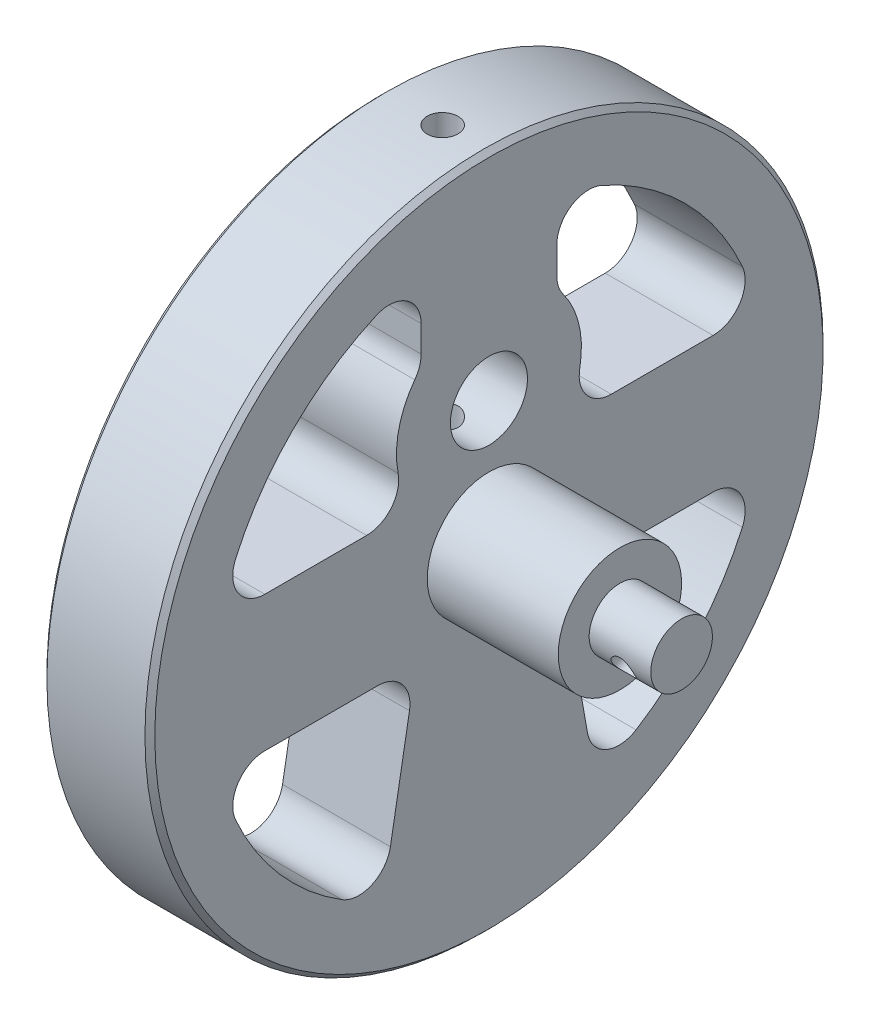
from build123d import *

# Parameters (mm, degrees)
SKETCH2_R               = 3.96875
CUT_EXTRUDE1_DEPTH      = 59.290656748
CUT_EXTRUDE3_DEPTH      = 54.228616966
SKETCH5_R               = 1.5875
CUT_EXTRUDE4_DEPTH      = 59.290656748
CUT_EXTRUDE2_DEPTH      = 59.290656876
CUT_EXTRUDE2_DEPTH_BACK = 59.290656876
SKETCH3_R               = 1.190625
CHAMFER1_SIZE           = 0.508


with BuildPart() as part:
    # Sketch1 → Revolve1 (revolve)
    with BuildSketch(Plane.XY, mode=Mode.PRIVATE) as revolve1_sk:
        Polygon((11.1125, 6.35), (24.60625, 6.35), (24.60625, 3.175), (30.95625, 3.175), (30.95625, 0), (0, 0), (0, 34.925), (11.1125, 34.925), align=None)
    revolve(revolve1_sk.sketch.rotate(Axis((0, 0, 0), (1, 0, 0)), 90), axis=Axis((0, 0, 0), (1, 0, 0)))

    # Sketch2 → Cut-Extrude1 (cut, through all)
    with BuildSketch(Plane.ZY):
        with Locations((0, 12.7)):
            Circle(SKETCH2_R)
    extrude(amount=-CUT_EXTRUDE1_DEPTH, mode=Mode.SUBTRACT)

    # Sketch4 → Cut-Extrude3 (cut, through all)
    with BuildSketch(Plane(origin=(11.1125, 0, 0), x_dir=(0, 0, -1), z_dir=(1, 0, 0))):
        with BuildLine():
            Line((6.985, 23.084673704), (6.985, 20.36221639))
            ThreePointArc((6.985, 20.36221639), (7.152725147, 19.323214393), (7.638861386, 18.389764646))
            ThreePointArc((7.638861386, 18.389764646), (9.283906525, 14.829484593), (9.354943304, 10.908168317))
            ThreePointArc((9.354943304, 10.908168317), (10.052965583, 8.183181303), (12.597990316, 6.985))
            Line((12.597990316, 6.985), (23.084673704, 6.985))
            ThreePointArc((23.084673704, 6.985), (25.854257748, 8.489054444), (26.100761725, 11.631030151))
            ThreePointArc((26.100761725, 11.631030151), (20.205576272, 20.205576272), (11.631030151, 26.100761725))
            ThreePointArc((11.631030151, 26.100761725), (8.489054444, 25.854257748), (6.985, 23.084673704))
        make_face()
        with BuildLine():
            Line((-6.985, 23.084673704), (-6.985, 20.36221639))
            ThreePointArc((-6.985, 20.36221639), (-7.152725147, 19.323214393), (-7.638861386, 18.389764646))
            ThreePointArc((-7.638861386, 18.389764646), (-9.283906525, 14.829484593), (-9.354943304, 10.908168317))
            ThreePointArc((-9.354943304, 10.908168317), (-10.052965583, 8.183181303), (-12.597990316, 6.985))
            Line((-12.597990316, 6.985), (-23.084673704, 6.985))
            ThreePointArc((-23.084673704, 6.985), (-25.854257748, 8.489054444), (-26.100761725, 11.631030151))
            ThreePointArc((-26.100761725, 11.631030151), (-20.205576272, 20.205576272), (-11.631030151, 26.100761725))
            ThreePointArc((-11.631030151, 26.100761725), (-8.489054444, 25.854257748), (-6.985, 23.084673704))
        make_face()
        with BuildLine():
            Line((23.084673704, -6.985), (11.436141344, -6.985))
            ThreePointArc((11.436141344, -6.985), (8.906662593, -8.164515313), (8.184306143, -10.860386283))
            Line((8.184306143, -10.860386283), (10.148725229, -22.001160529))
            ThreePointArc((10.148725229, -22.001160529), (12.058072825, -24.444549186), (15.15138742, -24.227382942))
            ThreePointArc((15.15138742, -24.227382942), (21.566223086, -18.746430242), (26.100761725, -11.631030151))
            ThreePointArc((26.100761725, -11.631030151), (25.854257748, -8.489054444), (23.084673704, -6.985))
        make_face()
        with BuildLine():
            Line((-11.436141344, -6.985), (-23.084673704, -6.985))
            ThreePointArc((-23.084673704, -6.985), (-25.854257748, -8.489054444), (-26.100761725, -11.631030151))
            ThreePointArc((-26.100761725, -11.631030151), (-21.566223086, -18.746430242), (-15.15138742, -24.227382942))
            ThreePointArc((-15.15138742, -24.227382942), (-12.058072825, -24.444549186), (-10.148725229, -22.001160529))
            Line((-10.148725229, -22.001160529), (-8.184306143, -10.860386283))
            ThreePointArc((-8.184306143, -10.860386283), (-8.906662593, -8.164515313), (-11.436141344, -6.985))
        make_face()
    extrude(amount=-CUT_EXTRUDE3_DEPTH, mode=Mode.SUBTRACT)

    # Sketch5 → Cut-Extrude4 (cut, through all)
    with BuildSketch(Plane(origin=(0, 0, 0), x_dir=(1, 0, 0), z_dir=(0, 1, 0))):
        with Locations(Location((6.35, 0, 0), (0, 0, 90))):
            Circle(SKETCH5_R)
    extrude(amount=CUT_EXTRUDE4_DEPTH, mode=Mode.SUBTRACT)

    # Sketch3 → Cut-Extrude2 (cut, two sides: drawn at the far end of the back side and taken through both)
    with BuildSketch(Plane(origin=(0, 0, 0), x_dir=(1, 0, 0), z_dir=(0, -0.46174861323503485, 0.8870108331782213)).offset(-CUT_EXTRUDE2_DEPTH_BACK)):
        with Locations(Location((27.78125, 0, 0), (0, 0, 270))):
            Circle(SKETCH3_R)
    extrude(amount=CUT_EXTRUDE2_DEPTH + CUT_EXTRUDE2_DEPTH_BACK, mode=Mode.SUBTRACT)

    # Chamfer1
    chamfer1_edges = [part.edges().sort_by_distance(p)[0] for p in [
        (0, 0, -34.925),
        (11.1125, 0, -34.925),
    ]]
    chamfer(chamfer1_edges, length=CHAMFER1_SIZE)


solid = part.part
